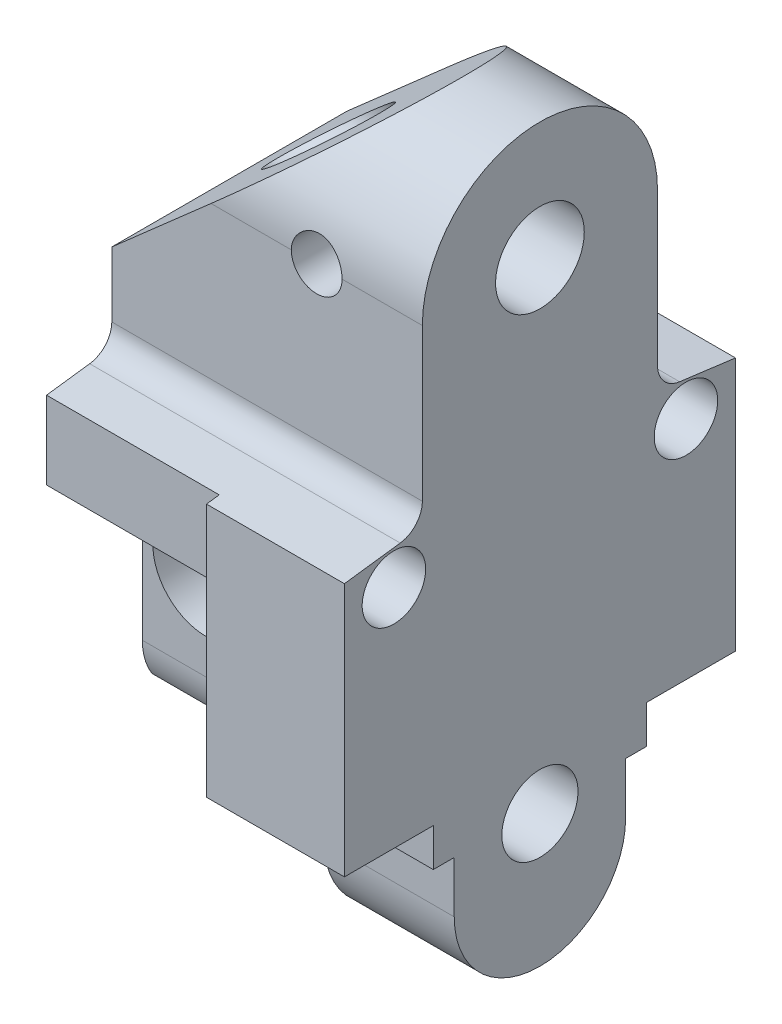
from build123d import *

# Parameters (mm, degrees)
SKETCH1_R           = 1.905
SKETCH1_R_2         = 2.2178391
BOSS_EXTRUDE1_DEPTH = 7.76605
SKETCH2_W           = 9.0297
SKETCH2_H           = 6.858
CUT_EXTRUDE1_DEPTH  = 7.76605
CUT_EXTRUDE2_DEPTH  = 9.0297
SKETCH5_R           = 1.5875
CUT_EXTRUDE3_DEPTH  = 12.7
FILLET2_R           = 1.27
SKETCH6_W           = 4.445
SKETCH6_H           = 8.89
CUT_EXTRUDE4_DEPTH  = 8.636
SKETCH6_4_W         = 1.04775
SKETCH6_4_H         = 1.905
BOSS_EXTRUDE2_DEPTH = 15.5321
SKETCH7_R           = 2.661534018
CUT_EXTRUDE5_DEPTH  = 12.7
CUT_EXTRUDE6_DEPTH  = 8.636
CUT_EXTRUDE7_DEPTH  = 0.635
CUT_EXTRUDE8_DEPTH  = 0.635
SKETCH11_R          = 1.27
CUT_EXTRUDE9_DEPTH  = 12.7


with BuildPart() as part:
    # Sketch1 → Boss-Extrude1 (new, symmetric)
    with BuildSketch(Plane(origin=(0, 0, 0), x_dir=(0, 0, -1), z_dir=(1, 0, 0))):
        with BuildLine():
            Line((-9.779, 8.763), (-9.779, 21.463))
            Line((-9.779, 21.463), (-5.8801, 21.971))
            Line((-5.8801, 21.971), (-5.8801, 30.6959))
            ThreePointArc((-5.8801, 30.6959), (0, 36.576), (5.8801, 30.6959))
            Line((5.8801, 30.6959), (5.8801, 21.971))
            Line((5.8801, 21.971), (9.779, 21.463))
            Line((9.779, 21.463), (9.779, 8.763))
            Line((9.779, 8.763), (4.28625, 8.763))
            Line((4.28625, 8.763), (4.28625, 4.28625))
            ThreePointArc((4.28625, 4.28625), (0, 0), (-4.28625, 4.28625))
            Line((-4.28625, 4.28625), (-4.28625, 8.763))
            Line((-4.28625, 8.763), (-9.779, 8.763))
        make_face()
        with Locations(Location((0, 6.62305, 0), (0, 0, 180))):
            Circle(SKETCH1_R, mode=Mode.SUBTRACT)
        with Locations(Location((0, 30.6959, 0), (0, 0, 180))):
            Circle(SKETCH1_R_2, mode=Mode.SUBTRACT)
    extrude(amount=BOSS_EXTRUDE1_DEPTH, both=True)

    # Sketch2 → Cut-Extrude1 (cut, symmetric)
    with BuildSketch(Plane.XY):
        Polygon((3.883025, 36.576), (-7.76605, 26.33345), (-11.065137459, 26.33345), (-11.065137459, 37.341338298), align=None)
        with Locations((-3.2512, 3.429)):
            Rectangle(SKETCH2_W, SKETCH2_H)
    extrude(amount=CUT_EXTRUDE1_DEPTH, both=True, mode=Mode.SUBTRACT)

    # Sketch3 → Cut-Extrude2 (cut)
    with BuildSketch(Plane.ZY.offset(7.76605)):
        with BuildLine():
            Line((-3.65125, 6.858), (-3.65125, 3.968410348))
            Line((-3.65125, 3.968410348), (3.65125, 3.968410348))
            Line((3.65125, 3.968410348), (3.65125, 6.858))
            ThreePointArc((3.65125, 6.858), (0, 10.058441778), (-3.65125, 6.858))
        make_face()
    extrude(amount=-CUT_EXTRUDE2_DEPTH, mode=Mode.SUBTRACT)

    # Sketch5 → Cut-Extrude3 (cut, symmetric)
    with BuildSketch(Plane(origin=(0, 0, 0), x_dir=(0, 0, -1), z_dir=(1, 0, 0))):
        with Locations((-7.3025, 20.066)):
            Circle(SKETCH5_R)
        with Locations((7.3025, 20.066)):
            Circle(SKETCH5_R)
    extrude(amount=CUT_EXTRUDE3_DEPTH, both=True, mode=Mode.SUBTRACT)

    # Fillet2
    fillet2_edges = [part.edges().sort_by_distance(p)[0] for p in [
        (0, 21.971, 5.8801),
        (0, 21.971, -5.8801),
    ]]
    fillet(fillet2_edges, radius=FILLET2_R)

    # Sketch6 → Cut-Extrude4 (cut)
    with BuildSketch(Plane.ZY.offset(7.76605)):
        with Locations((-7.5565, 13.208)):
            Rectangle(SKETCH6_W, SKETCH6_H)
        with Locations((7.5565, 13.208)):
            Rectangle(SKETCH6_W, SKETCH6_H)
    extrude(amount=-CUT_EXTRUDE4_DEPTH, mode=Mode.SUBTRACT)

    # Sketch6_4 → Boss-Extrude2 (add)
    with BuildSketch(Plane.ZY.offset(7.76605)):
        with Locations((4.810125, 7.8105)):
            Rectangle(SKETCH6_4_W, SKETCH6_4_H)
        with Locations((-4.810125, 7.8105)):
            Rectangle(SKETCH6_4_W, SKETCH6_4_H)
    extrude(amount=-BOSS_EXTRUDE2_DEPTH)

    # Sketch7 → Cut-Extrude5 (cut, symmetric)
    with BuildSketch(Plane.XY):
        with Locations((-4.582517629, 12.953080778)):
            Circle(SKETCH7_R)
    extrude(amount=CUT_EXTRUDE5_DEPTH, both=True, mode=Mode.SUBTRACT)

    # Sketch8 → Cut-Extrude6 (cut)
    with BuildSketch(Plane.ZY.offset(7.76605)):
        with BuildLine():
            Line((5.334, 6.858), (5.334, 16.484599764))
            Line((5.334, 16.484599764), (4.35251984, 16.484599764))
            Line((4.35251984, 16.484599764), (4.351681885, 8.533646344))
            ThreePointArc((4.351681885, 8.533646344), (4.229677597, 7.662350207), (3.873218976, 6.858))
            Line((3.873218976, 6.858), (4.286179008, 6.858))
            Line((4.286179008, 6.858), (5.334, 6.858))
        make_face()
        with BuildLine():
            Line((-4.10568025, 16.484599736), (-5.334, 16.484599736))
            Line((-5.334, 16.484599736), (-5.334, 6.858))
            Line((-5.334, 6.858), (-3.65125, 6.858))
            ThreePointArc((-3.65125, 6.858), (-3.649079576, 6.874147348), (-3.646837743, 6.890284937))
            ThreePointArc((-3.646837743, 6.890284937), (-3.988818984, 7.680928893), (-4.10568025, 8.534399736))
            Line((-4.10568025, 8.534399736), (-4.10568025, 16.484599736))
        make_face()
    extrude(amount=-CUT_EXTRUDE6_DEPTH, mode=Mode.SUBTRACT)

    # Sketch9 → Cut-Extrude7 (cut)
    with BuildSketch(Plane.XY.offset(9.779)):
        Polygon((-2.899226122, 16.483160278), (0.86995, 16.483160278), (0.86995, 17.653), (-7.76605, 17.653), (-7.76605, 21.463), (0.86995, 21.463), (0.86995, 24.857620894), (-13.663084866, 24.857620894), (-13.663084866, 16.483160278), (-7.00405, 16.483160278), (-3.833922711, 16.483160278), align=None)
        Polygon((-7.76605, 17.653), (0.86995, 17.653), (0.86995, 20.039153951), (0.86995, 21.463), (-7.76605, 21.463), align=None)
    extrude(amount=-CUT_EXTRUDE7_DEPTH, mode=Mode.SUBTRACT)

    # Sketch10 → Cut-Extrude8 (cut)
    with BuildSketch(Plane(origin=(0, 0, -9.779), x_dir=(-1, 0, 0), z_dir=(0, 0, -1))):
        Polygon((3.833922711, 16.483160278), (7.00405, 16.483160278), (13.663084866, 16.483160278), (13.663084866, 24.857620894), (-0.86995, 24.857620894), (-0.86995, 20.039153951), (-0.86995, 17.653), (-0.86995, 16.483160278), (2.899226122, 16.483160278), align=None)
    extrude(amount=-CUT_EXTRUDE8_DEPTH, mode=Mode.SUBTRACT)

    # Sketch11 → Cut-Extrude9 (cut, symmetric)
    with BuildSketch(Plane.XY):
        with Locations((2.480754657, 30.6959)):
            Circle(SKETCH11_R)
    extrude(amount=CUT_EXTRUDE9_DEPTH, both=True, mode=Mode.SUBTRACT)


solid = part.part
